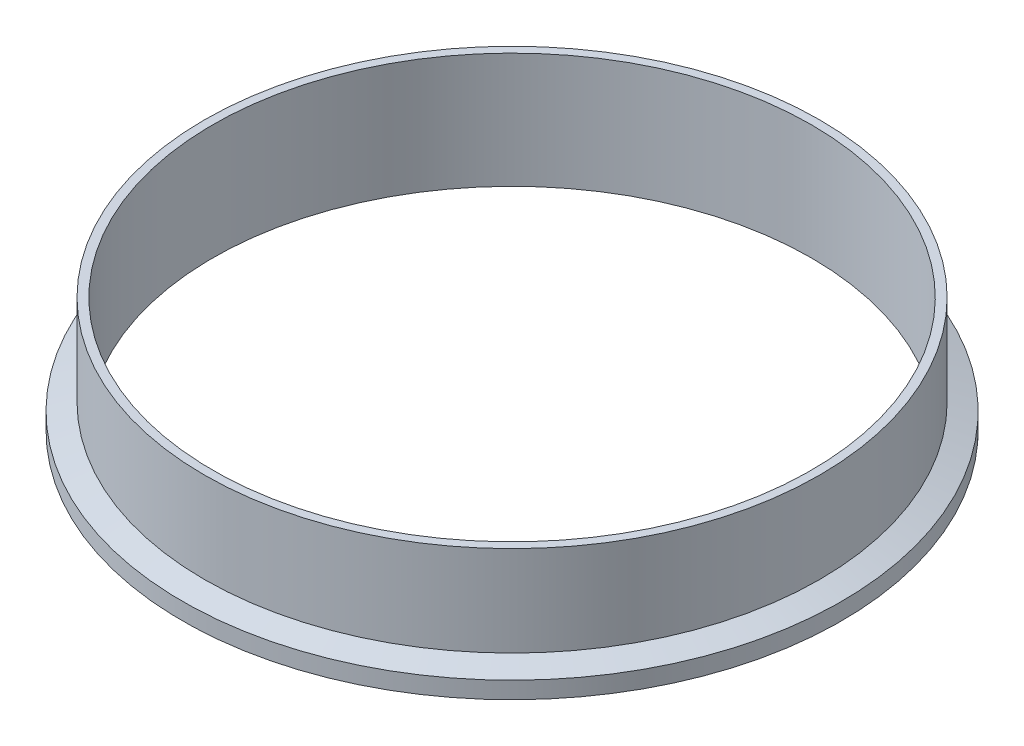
from build123d import *


with BuildPart() as part:
    # Sketch1 → Revolve2 (revolve)
    with BuildSketch(Plane.XY, mode=Mode.PRIVATE) as revolve2_sk:
        with BuildLine():
            Line((-98.8314, 0), (-98.8314, 38.1))
            Line((-98.8314, 38.1), (-101.6, 38.1))
            Line((-101.6, 38.1), (-101.6, 8.222780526))
            Line((-101.6, 8.222780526), (-108.839, 5.588))
            Line((-108.839, 5.588), (-108.839, 0))
            Line((-108.839, 0), (-105.399208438, 0))
            ThreePointArc((-105.399208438, 0), (-104.967011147, 0.129217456), (-104.676666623, 0.474458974))
            ThreePointArc((-104.676666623, 0.474458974), (-103.5812, 1.1938), (-102.485733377, 0.474458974))
            ThreePointArc((-102.485733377, 0.474458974), (-102.195388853, 0.129217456), (-101.763191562, 0))
            Line((-101.763191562, 0), (-98.8314, 0))
        make_face()
    revolve(revolve2_sk.sketch.rotate(Axis((0, 0, 0), (0, 1, 0)), 270), axis=Axis((0, 0, 0), (0, 1, 0)))


solid = part.part
